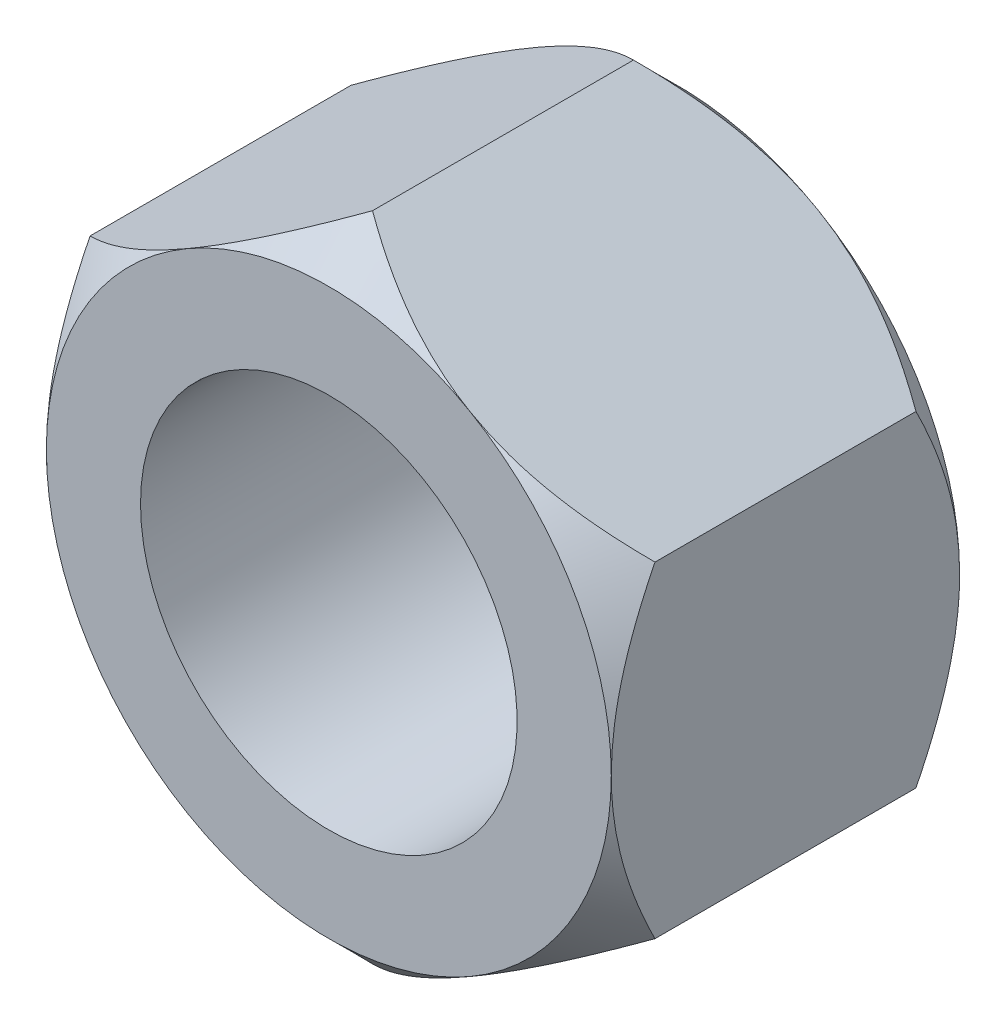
ISO-10303-21;
HEADER;
FILE_DESCRIPTION(('STEP AP214'),'2;1');
FILE_NAME('part.step','',(''),(''),'','','');
FILE_SCHEMA(('AUTOMOTIVE_DESIGN { 1 0 10303 214 1 1 1 1 }'));
ENDSEC;
DATA;
#1=APPLICATION_CONTEXT('core data for automotive mechanical design processes');
#2=APPLICATION_PROTOCOL_DEFINITION('international standard','automotive_design',2000,#1);
#3=PRODUCT_CONTEXT('',#1,'mechanical');
#4=PRODUCT('Part','Part','',(#3));
#5=PRODUCT_RELATED_PRODUCT_CATEGORY('part','',(#4));
#6=PRODUCT_DEFINITION_FORMATION('','',#4);
#7=PRODUCT_DEFINITION_CONTEXT('part definition',#1,'design');
#8=PRODUCT_DEFINITION('design','',#6,#7);
#9=PRODUCT_DEFINITION_SHAPE('','',#8);
#10=(LENGTH_UNIT() NAMED_UNIT(*) SI_UNIT(.MILLI.,.METRE.));
#11=(NAMED_UNIT(*) PLANE_ANGLE_UNIT() SI_UNIT($,.RADIAN.));
#12=(NAMED_UNIT(*) SI_UNIT($,.STERADIAN.) SOLID_ANGLE_UNIT());
#13=UNCERTAINTY_MEASURE_WITH_UNIT(LENGTH_MEASURE(1.E-05),#10,'distance_accuracy_value','');
#14=(GEOMETRIC_REPRESENTATION_CONTEXT(3) GLOBAL_UNCERTAINTY_ASSIGNED_CONTEXT((#13)) GLOBAL_UNIT_ASSIGNED_CONTEXT((#10,
#11,#12)) REPRESENTATION_CONTEXT('',''));
#15=CARTESIAN_POINT('',(0.,0.,0.));
#16=DIRECTION('',(0.,0.,1.));
#17=DIRECTION('',(1.,0.,0.));
#18=AXIS2_PLACEMENT_3D('',#15,#16,#17);
#19=CARTESIAN_POINT('',(0.,13.856406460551,14.8));
#20=DIRECTION('',(0.5,-0.866025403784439,0.));
#21=DIRECTION('',(0.866025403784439,0.5,0.));
#22=AXIS2_PLACEMENT_3D('',#19,#20,#21);
#23=PLANE('',#22);
#24=DIRECTION('',(0.,0.,-1.));
#25=VECTOR('',#24,1.);
#26=CARTESIAN_POINT('',(0.,13.856406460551,14.8));
#27=LINE('',#26,#25);
#28=CARTESIAN_POINT('',(0.,13.856406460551,12.943593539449));
#29=VERTEX_POINT('',#28);
#30=CARTESIAN_POINT('',(0.,13.856406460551,1.85640646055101));
#31=VERTEX_POINT('',#30);
#32=EDGE_CURVE('E199',#29,#31,#27,.T.);
#33=ORIENTED_EDGE('',*,*,#32,.T.);
#34=CARTESIAN_POINT('',(0.000199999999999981,13.8565219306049,1.85652193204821));
#35=CARTESIAN_POINT('',(-0.20610632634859,13.737410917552,1.73742850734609));
#36=CARTESIAN_POINT('',(-0.414028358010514,13.6173670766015,1.62196918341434));
#37=CARTESIAN_POINT('',(-0.833355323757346,13.3752685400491,1.39947310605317));
#38=CARTESIAN_POINT('',(-1.04476208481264,13.2532127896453,1.29244095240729));
#39=CARTESIAN_POINT('',(-1.47230711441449,13.006369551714,1.08750030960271));
#40=CARTESIAN_POINT('',(-1.68846554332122,12.8815704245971,0.98964756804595));
#41=CARTESIAN_POINT('',(-2.12433269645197,12.6299224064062,0.805191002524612));
#42=CARTESIAN_POINT('',(-2.34404087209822,12.5030738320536,0.718585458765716));
#43=CARTESIAN_POINT('',(-2.78347501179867,12.2493664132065,0.559363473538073));
#44=CARTESIAN_POINT('',(-3.00314697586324,12.1225387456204,0.486549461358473));
#45=CARTESIAN_POINT('',(-3.44557027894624,11.8671055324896,0.354726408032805));
#46=CARTESIAN_POINT('',(-3.66832128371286,11.7385001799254,0.295715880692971));
#47=CARTESIAN_POINT('',(-4.11594990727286,11.480061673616,0.192985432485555));
#48=CARTESIAN_POINT('',(-4.34082154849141,11.3502319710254,0.149231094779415));
#49=CARTESIAN_POINT('',(-4.79245266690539,11.0894826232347,0.0779744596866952));
#50=CARTESIAN_POINT('',(-5.01921185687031,10.9585631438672,0.050469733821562));
#51=CARTESIAN_POINT('',(-5.57180671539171,10.639522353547,0.00435195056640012));
#52=CARTESIAN_POINT('',(-5.8982396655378,10.4510562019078,-0.00532569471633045));
#53=CARTESIAN_POINT('',(-6.55051516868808,10.0744647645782,0.0109189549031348));
#54=CARTESIAN_POINT('',(-6.87635747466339,9.88633962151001,0.0368537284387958));
#55=CARTESIAN_POINT('',(-7.52497050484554,9.51186271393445,0.122792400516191));
#56=CARTESIAN_POINT('',(-7.84773738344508,9.32551316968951,0.182834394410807));
#57=CARTESIAN_POINT('',(-8.48772338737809,8.9560170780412,0.333723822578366));
#58=CARTESIAN_POINT('',(-8.80494293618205,8.77287028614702,0.424568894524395));
#59=CARTESIAN_POINT('',(-9.36804564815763,8.44776278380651,0.61145843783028));
#60=CARTESIAN_POINT('',(-9.61517605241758,8.30508197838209,0.702586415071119));
#61=CARTESIAN_POINT('',(-10.1050009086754,8.02228146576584,0.899526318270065));
#62=CARTESIAN_POINT('',(-10.3476952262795,7.88216183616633,1.00533868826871));
#63=CARTESIAN_POINT('',(-10.8278834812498,7.60492501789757,1.22927571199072));
#64=CARTESIAN_POINT('',(-11.0653910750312,7.4677999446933,1.3473616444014));
#65=CARTESIAN_POINT('',(-11.5360086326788,7.19608877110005,1.59429570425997));
#66=CARTESIAN_POINT('',(-11.769121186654,7.06150117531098,1.72313723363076));
#67=CARTESIAN_POINT('',(-12.0002,6.92808776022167,1.85652193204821));
#68=B_SPLINE_CURVE_WITH_KNOTS('',3,(#34,#35,#36,#37,#38,#39,#40,#41,#42,#43,#44,#45,#46,#47,#48,
#49,#50,#51,#52,#53,#54,#55,#56,#57,#58,#59,#60,#61,#62,#63,#64,#65,#66,#67),.UNSPECIFIED.,.F.,
.F.,(4,2,2,2,2,2,2,2,2,2,2,2,2,2,2,2,4),(0.,0.799031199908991,1.59849555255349,2.40253734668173,
3.20645605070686,3.99780391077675,4.78906652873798,5.57853238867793,6.36788023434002,
7.49728680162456,8.62708921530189,9.75815602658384,10.8891361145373,11.7873913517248,
12.6856737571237,13.58120361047,14.4761880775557),.UNSPECIFIED.);
#69=CARTESIAN_POINT('',(-6.,10.3923048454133,0.));
#70=VERTEX_POINT('',#69);
#71=EDGE_CURVE('E48',#31,#70,#68,.T.);
#72=ORIENTED_EDGE('',*,*,#71,.T.);
#73=CARTESIAN_POINT('',(-12.,6.92820323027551,1.85640646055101));
#74=VERTEX_POINT('',#73);
#75=EDGE_CURVE('E143',#70,#74,#68,.T.);
#76=ORIENTED_EDGE('',*,*,#75,.T.);
#77=DIRECTION('',(0.,0.,-1.));
#78=VECTOR('',#77,1.);
#79=CARTESIAN_POINT('',(-12.,6.92820323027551,14.8));
#80=LINE('',#79,#78);
#81=CARTESIAN_POINT('',(-12.,6.92820323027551,12.943593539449));
#82=VERTEX_POINT('',#81);
#83=EDGE_CURVE('E154',#82,#74,#80,.T.);
#84=ORIENTED_EDGE('',*,*,#83,.F.);
#85=CARTESIAN_POINT('',(0.0002,13.8565219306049,12.9434780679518));
#86=CARTESIAN_POINT('',(-0.206106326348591,13.737410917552,13.0625714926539));
#87=CARTESIAN_POINT('',(-0.414028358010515,13.6173670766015,13.1780308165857));
#88=CARTESIAN_POINT('',(-0.833355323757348,13.3752685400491,13.4005268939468));
#89=CARTESIAN_POINT('',(-1.04476208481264,13.2532127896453,13.5075590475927));
#90=CARTESIAN_POINT('',(-1.47230711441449,13.006369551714,13.7124996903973));
#91=CARTESIAN_POINT('',(-1.68846554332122,12.8815704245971,13.8103524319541));
#92=CARTESIAN_POINT('',(-2.12433269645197,12.6299224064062,13.9948089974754));
#93=CARTESIAN_POINT('',(-2.34404087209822,12.5030738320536,14.0814145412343));
#94=CARTESIAN_POINT('',(-2.78347501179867,12.2493664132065,14.2406365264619));
#95=CARTESIAN_POINT('',(-3.00314697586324,12.1225387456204,14.3134505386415));
#96=CARTESIAN_POINT('',(-3.44557027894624,11.8671055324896,14.4452735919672));
#97=CARTESIAN_POINT('',(-3.66832128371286,11.7385001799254,14.504284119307));
#98=CARTESIAN_POINT('',(-4.11594990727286,11.480061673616,14.6070145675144));
#99=CARTESIAN_POINT('',(-4.34082154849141,11.3502319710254,14.6507689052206));
#100=CARTESIAN_POINT('',(-4.79245266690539,11.0894826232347,14.7220255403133));
#101=CARTESIAN_POINT('',(-5.01921185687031,10.9585631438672,14.7495302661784));
#102=CARTESIAN_POINT('',(-5.57180671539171,10.639522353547,14.7956480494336));
#103=CARTESIAN_POINT('',(-5.8982396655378,10.4510562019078,14.8053256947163));
#104=CARTESIAN_POINT('',(-6.55051516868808,10.0744647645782,14.7890810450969));
#105=CARTESIAN_POINT('',(-6.87635747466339,9.88633962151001,14.7631462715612));
#106=CARTESIAN_POINT('',(-7.52497050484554,9.51186271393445,14.6772075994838));
#107=CARTESIAN_POINT('',(-7.84773738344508,9.32551316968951,14.6171656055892));
#108=CARTESIAN_POINT('',(-8.48772338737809,8.9560170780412,14.4662761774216));
#109=CARTESIAN_POINT('',(-8.80494293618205,8.77287028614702,14.3754311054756));
#110=CARTESIAN_POINT('',(-9.36804564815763,8.44776278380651,14.1885415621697));
#111=CARTESIAN_POINT('',(-9.61517605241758,8.30508197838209,14.0974135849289));
#112=CARTESIAN_POINT('',(-10.1050009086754,8.02228146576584,13.9004736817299));
#113=CARTESIAN_POINT('',(-10.3476952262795,7.88216183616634,13.7946613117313));
#114=CARTESIAN_POINT('',(-10.8278834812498,7.60492501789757,13.5707242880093));
#115=CARTESIAN_POINT('',(-11.0653910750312,7.4677999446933,13.4526383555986));
#116=CARTESIAN_POINT('',(-11.5360086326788,7.19608877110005,13.20570429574));
#117=CARTESIAN_POINT('',(-11.769121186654,7.06150117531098,13.0768627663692));
#118=CARTESIAN_POINT('',(-12.0002,6.92808776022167,12.9434780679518));
#119=B_SPLINE_CURVE_WITH_KNOTS('',3,(#85,#86,#87,#88,#89,#90,#91,#92,#93,#94,#95,#96,#97,#98,
#99,#100,#101,#102,#103,#104,#105,#106,#107,#108,#109,#110,#111,#112,#113,#114,#115,#116,#117,
#118),.UNSPECIFIED.,.F.,.F.,(4,2,2,2,2,2,2,2,2,2,2,2,2,2,2,2,4),(0.,0.799031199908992,
1.59849555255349,2.40253734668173,3.20645605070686,3.99780391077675,4.78906652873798,
5.57853238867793,6.36788023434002,7.49728680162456,8.62708921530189,9.75815602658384,
10.8891361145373,11.7873913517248,12.6856737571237,13.58120361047,14.4761880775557),.UNSPECIFIED.);
#120=CARTESIAN_POINT('',(-6.,10.3923048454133,14.8));
#121=VERTEX_POINT('',#120);
#122=EDGE_CURVE('E240',#121,#82,#119,.T.);
#123=ORIENTED_EDGE('',*,*,#122,.F.);
#124=EDGE_CURVE('E229',#29,#121,#119,.T.);
#125=ORIENTED_EDGE('',*,*,#124,.F.);
#126=EDGE_LOOP('',(#33,#72,#76,#84,#123,#125));
#127=FACE_BOUND('',#126,.T.);
#128=ADVANCED_FACE('F32',(#127),#23,.F.);
#129=CARTESIAN_POINT('',(-12.,6.92820323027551,14.8));
#130=DIRECTION('',(1.,0.,0.));
#131=DIRECTION('',(0.,0.,-1.));
#132=AXIS2_PLACEMENT_3D('',#129,#130,#131);
#133=PLANE('',#132);
#134=ORIENTED_EDGE('',*,*,#83,.T.);
#135=CARTESIAN_POINT('',(-12.,-17.3197983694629,9.07072413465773));
#136=CARTESIAN_POINT('',(-12.,-17.1018243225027,8.89155627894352));
#137=CARTESIAN_POINT('',(-12.,-16.8833157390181,8.71303891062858));
#138=CARTESIAN_POINT('',(-12.,-16.4451228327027,8.35744705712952));
#139=CARTESIAN_POINT('',(-12.,-16.225438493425,8.18037259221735));
#140=CARTESIAN_POINT('',(-12.,-15.5643649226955,7.65144903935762));
#141=CARTESIAN_POINT('',(-12.,-15.1210600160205,7.30198622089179));
#142=CARTESIAN_POINT('',(-12.,-14.2234399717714,6.60711121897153));
#143=CARTESIAN_POINT('',(-12.,-13.7690573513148,6.26178597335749));
#144=CARTESIAN_POINT('',(-12.,-12.8528218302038,5.58126706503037));
#145=CARTESIAN_POINT('',(-12.,-12.3909696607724,5.24607241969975));
#146=CARTESIAN_POINT('',(-12.,-11.4139919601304,4.55740600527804));
#147=CARTESIAN_POINT('',(-12.,-10.8979613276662,4.20520674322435));
#148=CARTESIAN_POINT('',(-12.,-10.1137064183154,3.69229585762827));
#149=CARTESIAN_POINT('',(-12.,-9.85053041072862,3.5238565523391));
#150=CARTESIAN_POINT('',(-12.,-9.32042416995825,3.19300363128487));
#151=CARTESIAN_POINT('',(-12.,-9.05349412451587,3.03058971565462));
#152=CARTESIAN_POINT('',(-12.,-8.51671146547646,2.71352101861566));
#153=CARTESIAN_POINT('',(-12.,-8.24687797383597,2.55883394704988));
#154=CARTESIAN_POINT('',(-12.,-7.70266171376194,2.25761649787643));
#155=CARTESIAN_POINT('',(-12.,-7.42827870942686,2.11108654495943));
#156=CARTESIAN_POINT('',(-12.,-6.8747809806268,1.82773083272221));
#157=CARTESIAN_POINT('',(-12.,-6.59566984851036,1.6908980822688));
#158=CARTESIAN_POINT('',(-12.,-6.03221467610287,1.42853162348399));
#159=CARTESIAN_POINT('',(-12.,-5.74787158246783,1.30299589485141));
#160=CARTESIAN_POINT('',(-12.,-5.25714492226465,1.09974243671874));
#161=CARTESIAN_POINT('',(-12.,-5.05212707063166,1.01873251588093));
#162=CARTESIAN_POINT('',(-12.,-4.63932060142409,0.864160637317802));
#163=CARTESIAN_POINT('',(-12.,-4.43153200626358,0.79059861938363));
#164=CARTESIAN_POINT('',(-12.,-3.8038926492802,0.5822904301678));
#165=CARTESIAN_POINT('',(-12.,-3.37975926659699,0.45991830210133));
#166=CARTESIAN_POINT('',(-12.,-2.74129224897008,0.307442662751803));
#167=CARTESIAN_POINT('',(-12.,-2.53050472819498,0.262144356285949));
#168=CARTESIAN_POINT('',(-12.,-2.10699413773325,0.181799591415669));
#169=CARTESIAN_POINT('',(-12.,-1.89427138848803,0.146751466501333));
#170=CARTESIAN_POINT('',(-12.,-1.46733523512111,0.0875300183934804));
#171=CARTESIAN_POINT('',(-12.,-1.25312197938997,0.0633556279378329));
#172=CARTESIAN_POINT('',(-12.,-0.82371476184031,0.0263361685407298));
#173=CARTESIAN_POINT('',(-12.,-0.608520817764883,0.0134908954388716));
#174=CARTESIAN_POINT('',(-12.,-0.189172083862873,-0.000240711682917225));
#175=CARTESIAN_POINT('',(-12.,0.0149632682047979,-0.00172481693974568));
#176=CARTESIAN_POINT('',(-12.,0.423066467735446,0.00572177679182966));
#177=CARTESIAN_POINT('',(-12.,0.627034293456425,0.0146536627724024));
#178=CARTESIAN_POINT('',(-12.,1.03424406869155,0.0427744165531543));
#179=CARTESIAN_POINT('',(-12.,1.23748607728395,0.0619624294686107));
#180=CARTESIAN_POINT('',(-12.,1.64279854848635,0.110253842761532));
#181=CARTESIAN_POINT('',(-12.,1.8448688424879,0.139358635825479));
#182=CARTESIAN_POINT('',(-12.,2.45637150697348,0.242161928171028));
#183=CARTESIAN_POINT('',(-12.,2.86336198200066,0.330792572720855));
#184=CARTESIAN_POINT('',(-12.,3.66816252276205,0.542100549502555));
#185=CARTESIAN_POINT('',(-12.,4.06597273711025,0.664777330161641));
#186=CARTESIAN_POINT('',(-12.,4.86071136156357,0.941581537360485));
#187=CARTESIAN_POINT('',(-12.,5.25740700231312,1.09637017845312));
#188=CARTESIAN_POINT('',(-12.,6.0406537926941,1.42995971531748));
#189=CARTESIAN_POINT('',(-12.,6.42720041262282,1.60877112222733));
#190=CARTESIAN_POINT('',(-12.,7.19193181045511,1.98616974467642));
#191=CARTESIAN_POINT('',(-12.,7.5700868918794,2.18481665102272));
#192=CARTESIAN_POINT('',(-12.,8.31775652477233,2.59753155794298));
#193=CARTESIAN_POINT('',(-12.,8.68727235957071,2.81159724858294));
#194=CARTESIAN_POINT('',(-12.,9.40069797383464,3.24126382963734));
#195=CARTESIAN_POINT('',(-12.,9.74497050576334,3.45626557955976));
#196=CARTESIAN_POINT('',(-12.,10.4275998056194,3.89549023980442));
#197=CARTESIAN_POINT('',(-12.,10.7659561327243,4.1197138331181));
#198=CARTESIAN_POINT('',(-12.,11.4348299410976,4.57393845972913));
#199=CARTESIAN_POINT('',(-12.,11.7653883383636,4.80387945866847));
#200=CARTESIAN_POINT('',(-12.,12.4219603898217,5.26997911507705));
#201=CARTESIAN_POINT('',(-12.,12.7479752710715,5.5061360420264));
#202=CARTESIAN_POINT('',(-12.,13.0720818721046,5.74483937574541));
#203=B_SPLINE_CURVE_WITH_KNOTS('',3,(#135,#136,#137,#138,#139,#140,#141,#142,#143,#144,#145,
#146,#147,#148,#149,#150,#151,#152,#153,#154,#155,#156,#157,#158,#159,#160,#161,#162,#163,#164,
#165,#166,#167,#168,#169,#170,#171,#172,#173,#174,#175,#176,#177,#178,#179,#180,#181,#182,#183,
#184,#185,#186,#187,#188,#189,#190,#191,#192,#193,#194,#195,#196,#197,#198,#199,#200,#201,#202),
.UNSPECIFIED.,.F.,.F.,(4,2,2,2,2,2,2,2,2,2,2,2,2,2,2,2,2,2,2,2,2,2,2,2,2,2,2,2,2,2,2,2,2,4),(0.,
0.846475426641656,1.69296272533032,3.38634499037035,5.09836828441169,6.81022498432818,
8.6840920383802,9.62141842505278,10.5586981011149,11.4916610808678,12.4246725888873,
13.3570044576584,14.2891692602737,14.9503568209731,15.6115390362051,16.9338740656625,
17.5804743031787,18.2269693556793,18.8734009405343,19.5198208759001,20.1319787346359,
20.7442063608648,21.3563829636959,21.9686455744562,23.2163337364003,24.464001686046,
25.7404988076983,27.0175562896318,28.2985797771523,29.5794117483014,30.7969195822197,
32.0145177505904,33.2224448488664,34.430039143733),.UNSPECIFIED.);
#204=CARTESIAN_POINT('',(-12.,0.,0.));
#205=VERTEX_POINT('',#204);
#206=EDGE_CURVE('E137',#74,#205,#203,.F.);
#207=ORIENTED_EDGE('',*,*,#206,.T.);
#208=CARTESIAN_POINT('',(-12.,-6.92820323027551,1.85640646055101));
#209=VERTEX_POINT('',#208);
#210=EDGE_CURVE('E125',#205,#209,#203,.F.);
#211=ORIENTED_EDGE('',*,*,#210,.T.);
#212=DIRECTION('',(0.,0.,-1.));
#213=VECTOR('',#212,1.);
#214=CARTESIAN_POINT('',(-12.,-6.92820323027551,14.8));
#215=LINE('',#214,#213);
#216=CARTESIAN_POINT('',(-12.,-6.92820323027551,12.943593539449));
#217=VERTEX_POINT('',#216);
#218=EDGE_CURVE('E321',#217,#209,#215,.T.);
#219=ORIENTED_EDGE('',*,*,#218,.F.);
#220=CARTESIAN_POINT('',(-12.,-17.3197983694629,5.72927586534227));
#221=CARTESIAN_POINT('',(-12.,-17.1018243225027,5.90844372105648));
#222=CARTESIAN_POINT('',(-12.,-16.8833157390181,6.08696108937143));
#223=CARTESIAN_POINT('',(-12.,-16.4451228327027,6.44255294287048));
#224=CARTESIAN_POINT('',(-12.,-16.225438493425,6.61962740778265));
#225=CARTESIAN_POINT('',(-12.,-15.5643649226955,7.14855096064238));
#226=CARTESIAN_POINT('',(-12.,-15.1210600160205,7.49801377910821));
#227=CARTESIAN_POINT('',(-12.,-14.2234399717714,8.19288878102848));
#228=CARTESIAN_POINT('',(-12.,-13.7690573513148,8.53821402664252));
#229=CARTESIAN_POINT('',(-12.,-12.8528218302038,9.21873293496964));
#230=CARTESIAN_POINT('',(-12.,-12.3909696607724,9.55392758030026));
#231=CARTESIAN_POINT('',(-12.,-11.4139919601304,10.242593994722));
#232=CARTESIAN_POINT('',(-12.,-10.8979613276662,10.5947932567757));
#233=CARTESIAN_POINT('',(-12.,-10.1137064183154,11.1077041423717));
#234=CARTESIAN_POINT('',(-12.,-9.85053041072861,11.2761434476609));
#235=CARTESIAN_POINT('',(-12.,-9.32042416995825,11.6069963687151));
#236=CARTESIAN_POINT('',(-12.,-9.05349412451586,11.7694102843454));
#237=CARTESIAN_POINT('',(-12.,-8.51671146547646,12.0864789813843));
#238=CARTESIAN_POINT('',(-12.,-8.24687797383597,12.2411660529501));
#239=CARTESIAN_POINT('',(-12.,-7.70266171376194,12.5423835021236));
#240=CARTESIAN_POINT('',(-12.,-7.42827870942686,12.6889134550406));
#241=CARTESIAN_POINT('',(-12.,-6.87478098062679,12.9722691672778));
#242=CARTESIAN_POINT('',(-12.,-6.59566984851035,13.1091019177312));
#243=CARTESIAN_POINT('',(-12.,-6.03221467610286,13.371468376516));
#244=CARTESIAN_POINT('',(-12.,-5.74787158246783,13.4970041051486));
#245=CARTESIAN_POINT('',(-12.,-5.25714492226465,13.7002575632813));
#246=CARTESIAN_POINT('',(-12.,-5.05212707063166,13.7812674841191));
#247=CARTESIAN_POINT('',(-12.,-4.63932060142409,13.9358393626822));
#248=CARTESIAN_POINT('',(-12.,-4.43153200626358,14.0094013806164));
#249=CARTESIAN_POINT('',(-12.,-3.8038926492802,14.2177095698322));
#250=CARTESIAN_POINT('',(-12.,-3.37975926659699,14.3400816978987));
#251=CARTESIAN_POINT('',(-12.,-2.74129224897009,14.4925573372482));
#252=CARTESIAN_POINT('',(-12.,-2.53050472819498,14.5378556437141));
#253=CARTESIAN_POINT('',(-12.,-2.10699413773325,14.6182004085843));
#254=CARTESIAN_POINT('',(-12.,-1.89427138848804,14.6532485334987));
#255=CARTESIAN_POINT('',(-12.,-1.46733523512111,14.7124699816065));
#256=CARTESIAN_POINT('',(-12.,-1.25312197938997,14.7366443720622));
#257=CARTESIAN_POINT('',(-12.,-0.823714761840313,14.7736638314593));
#258=CARTESIAN_POINT('',(-12.,-0.608520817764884,14.7865091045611));
#259=CARTESIAN_POINT('',(-12.,-0.189172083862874,14.8002407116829));
#260=CARTESIAN_POINT('',(-12.,0.0149632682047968,14.8017248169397));
#261=CARTESIAN_POINT('',(-12.,0.423066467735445,14.7942782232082));
#262=CARTESIAN_POINT('',(-12.,0.627034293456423,14.7853463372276));
#263=CARTESIAN_POINT('',(-12.,1.03424406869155,14.7572255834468));
#264=CARTESIAN_POINT('',(-12.,1.23748607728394,14.7380375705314));
#265=CARTESIAN_POINT('',(-12.,1.64279854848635,14.6897461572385));
#266=CARTESIAN_POINT('',(-12.,1.8448688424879,14.6606413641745));
#267=CARTESIAN_POINT('',(-12.,2.45637150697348,14.557838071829));
#268=CARTESIAN_POINT('',(-12.,2.86336198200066,14.4692074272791));
#269=CARTESIAN_POINT('',(-12.,3.66816252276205,14.2578994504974));
#270=CARTESIAN_POINT('',(-12.,4.06597273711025,14.1352226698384));
#271=CARTESIAN_POINT('',(-12.,4.86071136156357,13.8584184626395));
#272=CARTESIAN_POINT('',(-12.,5.25740700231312,13.7036298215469));
#273=CARTESIAN_POINT('',(-12.,6.0406537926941,13.3700402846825));
#274=CARTESIAN_POINT('',(-12.,6.42720041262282,13.1912288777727));
#275=CARTESIAN_POINT('',(-12.,7.19193181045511,12.8138302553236));
#276=CARTESIAN_POINT('',(-12.,7.5700868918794,12.6151833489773));
#277=CARTESIAN_POINT('',(-12.,8.31775652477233,12.202468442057));
#278=CARTESIAN_POINT('',(-12.,8.6872723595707,11.9884027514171));
#279=CARTESIAN_POINT('',(-12.,9.40069797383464,11.5587361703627));
#280=CARTESIAN_POINT('',(-12.,9.74497050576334,11.3437344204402));
#281=CARTESIAN_POINT('',(-12.,10.4275998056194,10.9045097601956));
#282=CARTESIAN_POINT('',(-12.,10.7659561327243,10.6802861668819));
#283=CARTESIAN_POINT('',(-12.,11.4348299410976,10.2260615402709));
#284=CARTESIAN_POINT('',(-12.,11.7653883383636,9.99612054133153));
#285=CARTESIAN_POINT('',(-12.,12.4219603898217,9.53002088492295));
#286=CARTESIAN_POINT('',(-12.,12.7479752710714,9.2938639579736));
#287=CARTESIAN_POINT('',(-12.,13.0720818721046,9.05516062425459));
#288=B_SPLINE_CURVE_WITH_KNOTS('',3,(#220,#221,#222,#223,#224,#225,#226,#227,#228,#229,#230,
#231,#232,#233,#234,#235,#236,#237,#238,#239,#240,#241,#242,#243,#244,#245,#246,#247,#248,#249,
#250,#251,#252,#253,#254,#255,#256,#257,#258,#259,#260,#261,#262,#263,#264,#265,#266,#267,#268,
#269,#270,#271,#272,#273,#274,#275,#276,#277,#278,#279,#280,#281,#282,#283,#284,#285,#286,#287),
.UNSPECIFIED.,.F.,.F.,(4,2,2,2,2,2,2,2,2,2,2,2,2,2,2,2,2,2,2,2,2,2,2,2,2,2,2,2,2,2,2,2,2,4),(0.,
0.846475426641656,1.69296272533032,3.38634499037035,5.09836828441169,6.81022498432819,
8.6840920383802,9.62141842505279,10.5586981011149,11.4916610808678,12.4246725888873,
13.3570044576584,14.2891692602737,14.9503568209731,15.6115390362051,16.9338740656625,
17.5804743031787,18.2269693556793,18.8734009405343,19.5198208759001,20.1319787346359,
20.7442063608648,21.3563829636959,21.9686455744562,23.2163337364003,24.464001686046,
25.7404988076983,27.0175562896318,28.2985797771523,29.5794117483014,30.7969195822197,
32.0145177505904,33.2224448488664,34.430039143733),.UNSPECIFIED.);
#289=CARTESIAN_POINT('',(-12.,0.,14.8));
#290=VERTEX_POINT('',#289);
#291=EDGE_CURVE('E184',#290,#217,#288,.F.);
#292=ORIENTED_EDGE('',*,*,#291,.F.);
#293=EDGE_CURVE('E191',#82,#290,#288,.F.);
#294=ORIENTED_EDGE('',*,*,#293,.F.);
#295=EDGE_LOOP('',(#134,#207,#211,#219,#292,#294));
#296=FACE_BOUND('',#295,.T.);
#297=ADVANCED_FACE('F151',(#296),#133,.F.);
#298=CARTESIAN_POINT('',(-12.,-6.92820323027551,14.8));
#299=DIRECTION('',(0.5,0.866025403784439,0.));
#300=DIRECTION('',(-0.866025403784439,0.5,0.));
#301=AXIS2_PLACEMENT_3D('',#298,#299,#300);
#302=PLANE('',#301);
#303=ORIENTED_EDGE('',*,*,#218,.T.);
#304=CARTESIAN_POINT('',(-12.0002,-6.92808776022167,1.85652193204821));
#305=CARTESIAN_POINT('',(-11.7938936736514,-7.04719877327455,1.73742850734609));
#306=CARTESIAN_POINT('',(-11.5859716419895,-7.16724261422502,1.62196918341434));
#307=CARTESIAN_POINT('',(-11.1666446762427,-7.40934115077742,1.39947310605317));
#308=CARTESIAN_POINT('',(-10.9552379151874,-7.5313969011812,1.29244095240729));
#309=CARTESIAN_POINT('',(-10.5276928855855,-7.77824013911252,1.08750030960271));
#310=CARTESIAN_POINT('',(-10.3115344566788,-7.90303926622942,0.989647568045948));
#311=CARTESIAN_POINT('',(-9.87566730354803,-8.15468728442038,0.80519100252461));
#312=CARTESIAN_POINT('',(-9.65595912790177,-8.28153585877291,0.718585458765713));
#313=CARTESIAN_POINT('',(-9.21652498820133,-8.53524327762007,0.55936347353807));
#314=CARTESIAN_POINT('',(-8.99685302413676,-8.66207094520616,0.48654946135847));
#315=CARTESIAN_POINT('',(-8.55442972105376,-8.91750415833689,0.354726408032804));
#316=CARTESIAN_POINT('',(-8.33167871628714,-9.04610951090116,0.295715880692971));
#317=CARTESIAN_POINT('',(-7.88405009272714,-9.30454801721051,0.192985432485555));
#318=CARTESIAN_POINT('',(-7.65917845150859,-9.43437771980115,0.149231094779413));
#319=CARTESIAN_POINT('',(-7.20754733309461,-9.69512706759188,0.0779744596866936));
#320=CARTESIAN_POINT('',(-6.98078814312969,-9.82604654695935,0.0504697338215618));
#321=CARTESIAN_POINT('',(-6.42819328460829,-10.1450873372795,0.0043519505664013));
#322=CARTESIAN_POINT('',(-6.1017603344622,-10.3335534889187,-0.00532569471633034));
#323=CARTESIAN_POINT('',(-5.44948483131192,-10.7101449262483,0.0109189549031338));
#324=CARTESIAN_POINT('',(-5.12364252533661,-10.8982700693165,0.036853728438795));
#325=CARTESIAN_POINT('',(-4.47502949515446,-11.2727469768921,0.122792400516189));
#326=CARTESIAN_POINT('',(-4.15226261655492,-11.459096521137,0.182834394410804));
#327=CARTESIAN_POINT('',(-3.51227661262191,-11.8285926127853,0.333723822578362));
#328=CARTESIAN_POINT('',(-3.19505706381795,-12.0117394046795,0.424568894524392));
#329=CARTESIAN_POINT('',(-2.63195435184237,-12.33684690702,0.611458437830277));
#330=CARTESIAN_POINT('',(-2.38482394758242,-12.4795277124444,0.702586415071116));
#331=CARTESIAN_POINT('',(-1.89499909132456,-12.7623282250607,0.899526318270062));
#332=CARTESIAN_POINT('',(-1.65230477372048,-12.9024478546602,1.00533868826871));
#333=CARTESIAN_POINT('',(-1.17211651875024,-13.179684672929,1.22927571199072));
#334=CARTESIAN_POINT('',(-0.934608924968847,-13.3168097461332,1.3473616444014));
#335=CARTESIAN_POINT('',(-0.463991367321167,-13.5885209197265,1.59429570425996));
#336=CARTESIAN_POINT('',(-0.230878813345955,-13.7231085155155,1.72313723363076));
#337=CARTESIAN_POINT('',(0.000199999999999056,-13.8565219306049,1.85652193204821));
#338=B_SPLINE_CURVE_WITH_KNOTS('',3,(#304,#305,#306,#307,#308,#309,#310,#311,#312,#313,#314,
#315,#316,#317,#318,#319,#320,#321,#322,#323,#324,#325,#326,#327,#328,#329,#330,#331,#332,#333,
#334,#335,#336,#337),.UNSPECIFIED.,.F.,.F.,(4,2,2,2,2,2,2,2,2,2,2,2,2,2,2,2,4),(0.,
0.799031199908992,1.5984955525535,2.40253734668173,3.20645605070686,3.99780391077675,
4.78906652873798,5.57853238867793,6.36788023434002,7.49728680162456,8.62708921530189,
9.75815602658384,10.8891361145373,11.7873913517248,12.6856737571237,13.58120361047,
14.4761880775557),.UNSPECIFIED.);
#339=CARTESIAN_POINT('',(-6.,-10.3923048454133,0.));
#340=VERTEX_POINT('',#339);
#341=EDGE_CURVE('E132',#209,#340,#338,.T.);
#342=ORIENTED_EDGE('',*,*,#341,.T.);
#343=CARTESIAN_POINT('',(0.,-13.856406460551,1.85640646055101));
#344=VERTEX_POINT('',#343);
#345=EDGE_CURVE('E165',#340,#344,#338,.T.);
#346=ORIENTED_EDGE('',*,*,#345,.T.);
#347=DIRECTION('',(0.,0.,-1.));
#348=VECTOR('',#347,1.);
#349=CARTESIAN_POINT('',(0.,-13.856406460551,14.8));
#350=LINE('',#349,#348);
#351=CARTESIAN_POINT('',(0.,-13.856406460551,12.943593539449));
#352=VERTEX_POINT('',#351);
#353=EDGE_CURVE('E322',#352,#344,#350,.T.);
#354=ORIENTED_EDGE('',*,*,#353,.F.);
#355=CARTESIAN_POINT('',(-12.0002,-6.92808776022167,12.9434780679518));
#356=CARTESIAN_POINT('',(-11.7938936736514,-7.04719877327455,13.0625714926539));
#357=CARTESIAN_POINT('',(-11.5859716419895,-7.16724261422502,13.1780308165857));
#358=CARTESIAN_POINT('',(-11.1666446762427,-7.40934115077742,13.4005268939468));
#359=CARTESIAN_POINT('',(-10.9552379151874,-7.5313969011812,13.5075590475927));
#360=CARTESIAN_POINT('',(-10.5276928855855,-7.77824013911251,13.7124996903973));
#361=CARTESIAN_POINT('',(-10.3115344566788,-7.90303926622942,13.8103524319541));
#362=CARTESIAN_POINT('',(-9.87566730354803,-8.15468728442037,13.9948089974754));
#363=CARTESIAN_POINT('',(-9.65595912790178,-8.2815358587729,14.0814145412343));
#364=CARTESIAN_POINT('',(-9.21652498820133,-8.53524327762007,14.2406365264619));
#365=CARTESIAN_POINT('',(-8.99685302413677,-8.66207094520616,14.3134505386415));
#366=CARTESIAN_POINT('',(-8.55442972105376,-8.91750415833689,14.4452735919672));
#367=CARTESIAN_POINT('',(-8.33167871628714,-9.04610951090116,14.504284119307));
#368=CARTESIAN_POINT('',(-7.88405009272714,-9.30454801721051,14.6070145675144));
#369=CARTESIAN_POINT('',(-7.65917845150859,-9.43437771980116,14.6507689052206));
#370=CARTESIAN_POINT('',(-7.20754733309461,-9.69512706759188,14.7220255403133));
#371=CARTESIAN_POINT('',(-6.98078814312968,-9.82604654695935,14.7495302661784));
#372=CARTESIAN_POINT('',(-6.42819328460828,-10.1450873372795,14.7956480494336));
#373=CARTESIAN_POINT('',(-6.10176033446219,-10.3335534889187,14.8053256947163));
#374=CARTESIAN_POINT('',(-5.44948483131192,-10.7101449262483,14.7890810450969));
#375=CARTESIAN_POINT('',(-5.1236425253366,-10.8982700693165,14.7631462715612));
#376=CARTESIAN_POINT('',(-4.47502949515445,-11.2727469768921,14.6772075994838));
#377=CARTESIAN_POINT('',(-4.15226261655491,-11.459096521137,14.6171656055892));
#378=CARTESIAN_POINT('',(-3.5122766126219,-11.8285926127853,14.4662761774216));
#379=CARTESIAN_POINT('',(-3.19505706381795,-12.0117394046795,14.3754311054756));
#380=CARTESIAN_POINT('',(-2.63195435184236,-12.33684690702,14.1885415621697));
#381=CARTESIAN_POINT('',(-2.38482394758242,-12.4795277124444,14.0974135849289));
#382=CARTESIAN_POINT('',(-1.89499909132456,-12.7623282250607,13.9004736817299));
#383=CARTESIAN_POINT('',(-1.65230477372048,-12.9024478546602,13.7946613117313));
#384=CARTESIAN_POINT('',(-1.17211651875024,-13.179684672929,13.5707242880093));
#385=CARTESIAN_POINT('',(-0.934608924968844,-13.3168097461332,13.4526383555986));
#386=CARTESIAN_POINT('',(-0.463991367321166,-13.5885209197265,13.20570429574));
#387=CARTESIAN_POINT('',(-0.230878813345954,-13.7231085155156,13.0768627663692));
#388=CARTESIAN_POINT('',(0.000199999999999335,-13.8565219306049,12.9434780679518));
#389=B_SPLINE_CURVE_WITH_KNOTS('',3,(#355,#356,#357,#358,#359,#360,#361,#362,#363,#364,#365,
#366,#367,#368,#369,#370,#371,#372,#373,#374,#375,#376,#377,#378,#379,#380,#381,#382,#383,#384,
#385,#386,#387,#388),.UNSPECIFIED.,.F.,.F.,(4,2,2,2,2,2,2,2,2,2,2,2,2,2,2,2,4),(0.,
0.79903119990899,1.59849555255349,2.40253734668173,3.20645605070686,3.99780391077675,
4.78906652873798,5.57853238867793,6.36788023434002,7.49728680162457,8.6270892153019,
9.75815602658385,10.8891361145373,11.7873913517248,12.6856737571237,13.58120361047,
14.4761880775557),.UNSPECIFIED.);
#390=CARTESIAN_POINT('',(-6.,-10.3923048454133,14.8));
#391=VERTEX_POINT('',#390);
#392=EDGE_CURVE('E193',#391,#352,#389,.T.);
#393=ORIENTED_EDGE('',*,*,#392,.F.);
#394=EDGE_CURVE('E192',#217,#391,#389,.T.);
#395=ORIENTED_EDGE('',*,*,#394,.F.);
#396=EDGE_LOOP('',(#303,#342,#346,#354,#393,#395));
#397=FACE_BOUND('',#396,.T.);
#398=ADVANCED_FACE('F179',(#397),#302,.F.);
#399=CARTESIAN_POINT('',(12.,-6.92820323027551,14.8));
#400=DIRECTION('',(0.5,-0.866025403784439,0.));
#401=DIRECTION('',(0.866025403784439,0.5,0.));
#402=AXIS2_PLACEMENT_3D('',#399,#400,#401);
#403=PLANE('',#402);
#404=CARTESIAN_POINT('',(12.0002,-6.92808776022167,1.85652193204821));
#405=CARTESIAN_POINT('',(11.7938936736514,-7.04719877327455,1.73742850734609));
#406=CARTESIAN_POINT('',(11.5859716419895,-7.16724261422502,1.62196918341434));
#407=CARTESIAN_POINT('',(11.1666446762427,-7.40934115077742,1.39947310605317));
#408=CARTESIAN_POINT('',(10.9552379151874,-7.5313969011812,1.29244095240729));
#409=CARTESIAN_POINT('',(10.5276928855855,-7.77824013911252,1.08750030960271));
#410=CARTESIAN_POINT('',(10.3115344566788,-7.90303926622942,0.989647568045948));
#411=CARTESIAN_POINT('',(9.87566730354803,-8.15468728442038,0.80519100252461));
#412=CARTESIAN_POINT('',(9.65595912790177,-8.28153585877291,0.718585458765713));
#413=CARTESIAN_POINT('',(9.21652498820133,-8.53524327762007,0.55936347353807));
#414=CARTESIAN_POINT('',(8.99685302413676,-8.66207094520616,0.48654946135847));
#415=CARTESIAN_POINT('',(8.55442972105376,-8.91750415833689,0.354726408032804));
#416=CARTESIAN_POINT('',(8.33167871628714,-9.04610951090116,0.295715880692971));
#417=CARTESIAN_POINT('',(7.88405009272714,-9.30454801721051,0.192985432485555));
#418=CARTESIAN_POINT('',(7.65917845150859,-9.43437771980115,0.149231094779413));
#419=CARTESIAN_POINT('',(7.20754733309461,-9.69512706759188,0.0779744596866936));
#420=CARTESIAN_POINT('',(6.98078814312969,-9.82604654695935,0.0504697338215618));
#421=CARTESIAN_POINT('',(6.42819328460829,-10.1450873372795,0.0043519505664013));
#422=CARTESIAN_POINT('',(6.1017603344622,-10.3335534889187,-0.00532569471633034));
#423=CARTESIAN_POINT('',(5.44948483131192,-10.7101449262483,0.0109189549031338));
#424=CARTESIAN_POINT('',(5.12364252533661,-10.8982700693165,0.036853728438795));
#425=CARTESIAN_POINT('',(4.47502949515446,-11.2727469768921,0.122792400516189));
#426=CARTESIAN_POINT('',(4.15226261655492,-11.459096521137,0.182834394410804));
#427=CARTESIAN_POINT('',(3.51227661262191,-11.8285926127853,0.333723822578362));
#428=CARTESIAN_POINT('',(3.19505706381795,-12.0117394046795,0.424568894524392));
#429=CARTESIAN_POINT('',(2.63195435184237,-12.33684690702,0.611458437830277));
#430=CARTESIAN_POINT('',(2.38482394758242,-12.4795277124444,0.702586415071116));
#431=CARTESIAN_POINT('',(1.89499909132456,-12.7623282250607,0.899526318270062));
#432=CARTESIAN_POINT('',(1.65230477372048,-12.9024478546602,1.00533868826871));
#433=CARTESIAN_POINT('',(1.17211651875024,-13.179684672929,1.22927571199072));
#434=CARTESIAN_POINT('',(0.934608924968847,-13.3168097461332,1.3473616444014));
#435=CARTESIAN_POINT('',(0.463991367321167,-13.5885209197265,1.59429570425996));
#436=CARTESIAN_POINT('',(0.230878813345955,-13.7231085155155,1.72313723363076));
#437=CARTESIAN_POINT('',(-0.000199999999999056,-13.8565219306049,1.85652193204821));
#438=B_SPLINE_CURVE_WITH_KNOTS('',3,(#404,#405,#406,#407,#408,#409,#410,#411,#412,#413,#414,
#415,#416,#417,#418,#419,#420,#421,#422,#423,#424,#425,#426,#427,#428,#429,#430,#431,#432,#433,
#434,#435,#436,#437),.UNSPECIFIED.,.F.,.F.,(4,2,2,2,2,2,2,2,2,2,2,2,2,2,2,2,4),(0.,
0.799031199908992,1.5984955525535,2.40253734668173,3.20645605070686,3.99780391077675,
4.78906652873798,5.57853238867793,6.36788023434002,7.49728680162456,8.62708921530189,
9.75815602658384,10.8891361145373,11.7873913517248,12.6856737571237,13.58120361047,
14.4761880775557),.UNSPECIFIED.);
#439=CARTESIAN_POINT('',(12.,-6.92820323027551,1.85640646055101));
#440=VERTEX_POINT('',#439);
#441=CARTESIAN_POINT('',(6.,-10.3923048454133,0.));
#442=VERTEX_POINT('',#441);
#443=EDGE_CURVE('E249',#440,#442,#438,.T.);
#444=ORIENTED_EDGE('',*,*,#443,.F.);
#445=DIRECTION('',(0.,0.,-1.));
#446=VECTOR('',#445,1.);
#447=CARTESIAN_POINT('',(12.,-6.92820323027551,14.8));
#448=LINE('',#447,#446);
#449=CARTESIAN_POINT('',(12.,-6.92820323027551,12.943593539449));
#450=VERTEX_POINT('',#449);
#451=EDGE_CURVE('E326',#450,#440,#448,.T.);
#452=ORIENTED_EDGE('',*,*,#451,.F.);
#453=CARTESIAN_POINT('',(12.0002,-6.92808776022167,12.9434780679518));
#454=CARTESIAN_POINT('',(11.7938936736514,-7.04719877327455,13.0625714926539));
#455=CARTESIAN_POINT('',(11.5859716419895,-7.16724261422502,13.1780308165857));
#456=CARTESIAN_POINT('',(11.1666446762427,-7.40934115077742,13.4005268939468));
#457=CARTESIAN_POINT('',(10.9552379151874,-7.5313969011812,13.5075590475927));
#458=CARTESIAN_POINT('',(10.5276928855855,-7.77824013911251,13.7124996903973));
#459=CARTESIAN_POINT('',(10.3115344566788,-7.90303926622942,13.8103524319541));
#460=CARTESIAN_POINT('',(9.87566730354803,-8.15468728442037,13.9948089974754));
#461=CARTESIAN_POINT('',(9.65595912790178,-8.2815358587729,14.0814145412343));
#462=CARTESIAN_POINT('',(9.21652498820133,-8.53524327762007,14.2406365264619));
#463=CARTESIAN_POINT('',(8.99685302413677,-8.66207094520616,14.3134505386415));
#464=CARTESIAN_POINT('',(8.55442972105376,-8.91750415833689,14.4452735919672));
#465=CARTESIAN_POINT('',(8.33167871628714,-9.04610951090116,14.504284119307));
#466=CARTESIAN_POINT('',(7.88405009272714,-9.30454801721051,14.6070145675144));
#467=CARTESIAN_POINT('',(7.65917845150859,-9.43437771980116,14.6507689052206));
#468=CARTESIAN_POINT('',(7.20754733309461,-9.69512706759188,14.7220255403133));
#469=CARTESIAN_POINT('',(6.98078814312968,-9.82604654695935,14.7495302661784));
#470=CARTESIAN_POINT('',(6.42819328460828,-10.1450873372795,14.7956480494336));
#471=CARTESIAN_POINT('',(6.10176033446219,-10.3335534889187,14.8053256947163));
#472=CARTESIAN_POINT('',(5.44948483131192,-10.7101449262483,14.7890810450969));
#473=CARTESIAN_POINT('',(5.1236425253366,-10.8982700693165,14.7631462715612));
#474=CARTESIAN_POINT('',(4.47502949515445,-11.2727469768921,14.6772075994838));
#475=CARTESIAN_POINT('',(4.15226261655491,-11.459096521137,14.6171656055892));
#476=CARTESIAN_POINT('',(3.5122766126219,-11.8285926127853,14.4662761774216));
#477=CARTESIAN_POINT('',(3.19505706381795,-12.0117394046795,14.3754311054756));
#478=CARTESIAN_POINT('',(2.63195435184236,-12.33684690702,14.1885415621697));
#479=CARTESIAN_POINT('',(2.38482394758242,-12.4795277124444,14.0974135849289));
#480=CARTESIAN_POINT('',(1.89499909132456,-12.7623282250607,13.9004736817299));
#481=CARTESIAN_POINT('',(1.65230477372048,-12.9024478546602,13.7946613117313));
#482=CARTESIAN_POINT('',(1.17211651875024,-13.179684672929,13.5707242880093));
#483=CARTESIAN_POINT('',(0.934608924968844,-13.3168097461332,13.4526383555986));
#484=CARTESIAN_POINT('',(0.463991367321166,-13.5885209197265,13.20570429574));
#485=CARTESIAN_POINT('',(0.230878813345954,-13.7231085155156,13.0768627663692));
#486=CARTESIAN_POINT('',(-0.000199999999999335,-13.8565219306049,12.9434780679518));
#487=B_SPLINE_CURVE_WITH_KNOTS('',3,(#453,#454,#455,#456,#457,#458,#459,#460,#461,#462,#463,
#464,#465,#466,#467,#468,#469,#470,#471,#472,#473,#474,#475,#476,#477,#478,#479,#480,#481,#482,
#483,#484,#485,#486),.UNSPECIFIED.,.F.,.F.,(4,2,2,2,2,2,2,2,2,2,2,2,2,2,2,2,4),(0.,
0.79903119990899,1.59849555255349,2.40253734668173,3.20645605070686,3.99780391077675,
4.78906652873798,5.57853238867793,6.36788023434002,7.49728680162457,8.6270892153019,
9.75815602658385,10.8891361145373,11.7873913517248,12.6856737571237,13.58120361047,
14.4761880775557),.UNSPECIFIED.);
#488=CARTESIAN_POINT('',(6.,-10.3923048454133,14.8));
#489=VERTEX_POINT('',#488);
#490=EDGE_CURVE('E234',#450,#489,#487,.T.);
#491=ORIENTED_EDGE('',*,*,#490,.T.);
#492=EDGE_CURVE('E242',#489,#352,#487,.T.);
#493=ORIENTED_EDGE('',*,*,#492,.T.);
#494=ORIENTED_EDGE('',*,*,#353,.T.);
#495=EDGE_CURVE('E56',#442,#344,#438,.T.);
#496=ORIENTED_EDGE('',*,*,#495,.F.);
#497=EDGE_LOOP('',(#444,#452,#491,#493,#494,#496));
#498=FACE_BOUND('',#497,.T.);
#499=ADVANCED_FACE('F243',(#498),#403,.T.);
#500=CARTESIAN_POINT('',(12.,6.92820323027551,14.8));
#501=DIRECTION('',(1.,0.,0.));
#502=DIRECTION('',(0.,0.,-1.));
#503=AXIS2_PLACEMENT_3D('',#500,#501,#502);
#504=PLANE('',#503);
#505=CARTESIAN_POINT('',(12.,-17.3197983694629,9.07072413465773));
#506=CARTESIAN_POINT('',(12.,-17.1018243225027,8.89155627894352));
#507=CARTESIAN_POINT('',(12.,-16.8833157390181,8.71303891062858));
#508=CARTESIAN_POINT('',(12.,-16.4451228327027,8.35744705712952));
#509=CARTESIAN_POINT('',(12.,-16.225438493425,8.18037259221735));
#510=CARTESIAN_POINT('',(12.,-15.5643649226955,7.65144903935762));
#511=CARTESIAN_POINT('',(12.,-15.1210600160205,7.30198622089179));
#512=CARTESIAN_POINT('',(12.,-14.2234399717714,6.60711121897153));
#513=CARTESIAN_POINT('',(12.,-13.7690573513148,6.26178597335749));
#514=CARTESIAN_POINT('',(12.,-12.8528218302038,5.58126706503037));
#515=CARTESIAN_POINT('',(12.,-12.3909696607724,5.24607241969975));
#516=CARTESIAN_POINT('',(12.,-11.4139919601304,4.55740600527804));
#517=CARTESIAN_POINT('',(12.,-10.8979613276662,4.20520674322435));
#518=CARTESIAN_POINT('',(12.,-10.1137064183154,3.69229585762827));
#519=CARTESIAN_POINT('',(12.,-9.85053041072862,3.5238565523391));
#520=CARTESIAN_POINT('',(12.,-9.32042416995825,3.19300363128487));
#521=CARTESIAN_POINT('',(12.,-9.05349412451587,3.03058971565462));
#522=CARTESIAN_POINT('',(12.,-8.51671146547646,2.71352101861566));
#523=CARTESIAN_POINT('',(12.,-8.24687797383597,2.55883394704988));
#524=CARTESIAN_POINT('',(12.,-7.70266171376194,2.25761649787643));
#525=CARTESIAN_POINT('',(12.,-7.42827870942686,2.11108654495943));
#526=CARTESIAN_POINT('',(12.,-6.8747809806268,1.82773083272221));
#527=CARTESIAN_POINT('',(12.,-6.59566984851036,1.6908980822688));
#528=CARTESIAN_POINT('',(12.,-6.03221467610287,1.42853162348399));
#529=CARTESIAN_POINT('',(12.,-5.74787158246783,1.30299589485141));
#530=CARTESIAN_POINT('',(12.,-5.25714492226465,1.09974243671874));
#531=CARTESIAN_POINT('',(12.,-5.05212707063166,1.01873251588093));
#532=CARTESIAN_POINT('',(12.,-4.63932060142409,0.864160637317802));
#533=CARTESIAN_POINT('',(12.,-4.43153200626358,0.79059861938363));
#534=CARTESIAN_POINT('',(12.,-3.8038926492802,0.5822904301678));
#535=CARTESIAN_POINT('',(12.,-3.37975926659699,0.45991830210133));
#536=CARTESIAN_POINT('',(12.,-2.74129224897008,0.307442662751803));
#537=CARTESIAN_POINT('',(12.,-2.53050472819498,0.262144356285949));
#538=CARTESIAN_POINT('',(12.,-2.10699413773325,0.181799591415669));
#539=CARTESIAN_POINT('',(12.,-1.89427138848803,0.146751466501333));
#540=CARTESIAN_POINT('',(12.,-1.46733523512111,0.0875300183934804));
#541=CARTESIAN_POINT('',(12.,-1.25312197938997,0.0633556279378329));
#542=CARTESIAN_POINT('',(12.,-0.82371476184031,0.0263361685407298));
#543=CARTESIAN_POINT('',(12.,-0.608520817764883,0.0134908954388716));
#544=CARTESIAN_POINT('',(12.,-0.189172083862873,-0.000240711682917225));
#545=CARTESIAN_POINT('',(12.,0.0149632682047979,-0.00172481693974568));
#546=CARTESIAN_POINT('',(12.,0.423066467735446,0.00572177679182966));
#547=CARTESIAN_POINT('',(12.,0.627034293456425,0.0146536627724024));
#548=CARTESIAN_POINT('',(12.,1.03424406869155,0.0427744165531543));
#549=CARTESIAN_POINT('',(12.,1.23748607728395,0.0619624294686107));
#550=CARTESIAN_POINT('',(12.,1.64279854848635,0.110253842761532));
#551=CARTESIAN_POINT('',(12.,1.8448688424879,0.139358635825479));
#552=CARTESIAN_POINT('',(12.,2.45637150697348,0.242161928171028));
#553=CARTESIAN_POINT('',(12.,2.86336198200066,0.330792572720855));
#554=CARTESIAN_POINT('',(12.,3.66816252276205,0.542100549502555));
#555=CARTESIAN_POINT('',(12.,4.06597273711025,0.664777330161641));
#556=CARTESIAN_POINT('',(12.,4.86071136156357,0.941581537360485));
#557=CARTESIAN_POINT('',(12.,5.25740700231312,1.09637017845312));
#558=CARTESIAN_POINT('',(12.,6.0406537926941,1.42995971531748));
#559=CARTESIAN_POINT('',(12.,6.42720041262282,1.60877112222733));
#560=CARTESIAN_POINT('',(12.,7.19193181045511,1.98616974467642));
#561=CARTESIAN_POINT('',(12.,7.5700868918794,2.18481665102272));
#562=CARTESIAN_POINT('',(12.,8.31775652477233,2.59753155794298));
#563=CARTESIAN_POINT('',(12.,8.68727235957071,2.81159724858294));
#564=CARTESIAN_POINT('',(12.,9.40069797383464,3.24126382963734));
#565=CARTESIAN_POINT('',(12.,9.74497050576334,3.45626557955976));
#566=CARTESIAN_POINT('',(12.,10.4275998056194,3.89549023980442));
#567=CARTESIAN_POINT('',(12.,10.7659561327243,4.1197138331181));
#568=CARTESIAN_POINT('',(12.,11.4348299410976,4.57393845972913));
#569=CARTESIAN_POINT('',(12.,11.7653883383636,4.80387945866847));
#570=CARTESIAN_POINT('',(12.,12.4219603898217,5.26997911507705));
#571=CARTESIAN_POINT('',(12.,12.7479752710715,5.5061360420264));
#572=CARTESIAN_POINT('',(12.,13.0720818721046,5.74483937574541));
#573=B_SPLINE_CURVE_WITH_KNOTS('',3,(#505,#506,#507,#508,#509,#510,#511,#512,#513,#514,#515,
#516,#517,#518,#519,#520,#521,#522,#523,#524,#525,#526,#527,#528,#529,#530,#531,#532,#533,#534,
#535,#536,#537,#538,#539,#540,#541,#542,#543,#544,#545,#546,#547,#548,#549,#550,#551,#552,#553,
#554,#555,#556,#557,#558,#559,#560,#561,#562,#563,#564,#565,#566,#567,#568,#569,#570,#571,#572),
.UNSPECIFIED.,.F.,.F.,(4,2,2,2,2,2,2,2,2,2,2,2,2,2,2,2,2,2,2,2,2,2,2,2,2,2,2,2,2,2,2,2,2,4),(0.,
0.846475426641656,1.69296272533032,3.38634499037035,5.09836828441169,6.81022498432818,
8.6840920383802,9.62141842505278,10.5586981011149,11.4916610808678,12.4246725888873,
13.3570044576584,14.2891692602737,14.9503568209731,15.6115390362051,16.9338740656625,
17.5804743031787,18.2269693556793,18.8734009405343,19.5198208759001,20.1319787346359,
20.7442063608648,21.3563829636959,21.9686455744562,23.2163337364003,24.464001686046,
25.7404988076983,27.0175562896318,28.2985797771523,29.5794117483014,30.7969195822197,
32.0145177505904,33.2224448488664,34.430039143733),.UNSPECIFIED.);
#574=CARTESIAN_POINT('',(12.,6.92820323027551,1.85640646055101));
#575=VERTEX_POINT('',#574);
#576=CARTESIAN_POINT('',(12.,0.,0.));
#577=VERTEX_POINT('',#576);
#578=EDGE_CURVE('E261',#575,#577,#573,.F.);
#579=ORIENTED_EDGE('',*,*,#578,.F.);
#580=DIRECTION('',(0.,0.,-1.));
#581=VECTOR('',#580,1.);
#582=CARTESIAN_POINT('',(12.,6.92820323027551,14.8));
#583=LINE('',#582,#581);
#584=CARTESIAN_POINT('',(12.,6.92820323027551,12.943593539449));
#585=VERTEX_POINT('',#584);
#586=EDGE_CURVE('E303',#585,#575,#583,.T.);
#587=ORIENTED_EDGE('',*,*,#586,.F.);
#588=CARTESIAN_POINT('',(12.,-17.3197983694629,5.72927586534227));
#589=CARTESIAN_POINT('',(12.,-17.1018243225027,5.90844372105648));
#590=CARTESIAN_POINT('',(12.,-16.8833157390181,6.08696108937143));
#591=CARTESIAN_POINT('',(12.,-16.4451228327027,6.44255294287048));
#592=CARTESIAN_POINT('',(12.,-16.225438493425,6.61962740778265));
#593=CARTESIAN_POINT('',(12.,-15.5643649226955,7.14855096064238));
#594=CARTESIAN_POINT('',(12.,-15.1210600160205,7.49801377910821));
#595=CARTESIAN_POINT('',(12.,-14.2234399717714,8.19288878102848));
#596=CARTESIAN_POINT('',(12.,-13.7690573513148,8.53821402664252));
#597=CARTESIAN_POINT('',(12.,-12.8528218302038,9.21873293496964));
#598=CARTESIAN_POINT('',(12.,-12.3909696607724,9.55392758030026));
#599=CARTESIAN_POINT('',(12.,-11.4139919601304,10.242593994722));
#600=CARTESIAN_POINT('',(12.,-10.8979613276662,10.5947932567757));
#601=CARTESIAN_POINT('',(12.,-10.1137064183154,11.1077041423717));
#602=CARTESIAN_POINT('',(12.,-9.85053041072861,11.2761434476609));
#603=CARTESIAN_POINT('',(12.,-9.32042416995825,11.6069963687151));
#604=CARTESIAN_POINT('',(12.,-9.05349412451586,11.7694102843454));
#605=CARTESIAN_POINT('',(12.,-8.51671146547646,12.0864789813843));
#606=CARTESIAN_POINT('',(12.,-8.24687797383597,12.2411660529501));
#607=CARTESIAN_POINT('',(12.,-7.70266171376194,12.5423835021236));
#608=CARTESIAN_POINT('',(12.,-7.42827870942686,12.6889134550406));
#609=CARTESIAN_POINT('',(12.,-6.87478098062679,12.9722691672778));
#610=CARTESIAN_POINT('',(12.,-6.59566984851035,13.1091019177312));
#611=CARTESIAN_POINT('',(12.,-6.03221467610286,13.371468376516));
#612=CARTESIAN_POINT('',(12.,-5.74787158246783,13.4970041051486));
#613=CARTESIAN_POINT('',(12.,-5.25714492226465,13.7002575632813));
#614=CARTESIAN_POINT('',(12.,-5.05212707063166,13.7812674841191));
#615=CARTESIAN_POINT('',(12.,-4.63932060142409,13.9358393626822));
#616=CARTESIAN_POINT('',(12.,-4.43153200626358,14.0094013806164));
#617=CARTESIAN_POINT('',(12.,-3.8038926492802,14.2177095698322));
#618=CARTESIAN_POINT('',(12.,-3.37975926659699,14.3400816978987));
#619=CARTESIAN_POINT('',(12.,-2.74129224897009,14.4925573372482));
#620=CARTESIAN_POINT('',(12.,-2.53050472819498,14.5378556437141));
#621=CARTESIAN_POINT('',(12.,-2.10699413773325,14.6182004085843));
#622=CARTESIAN_POINT('',(12.,-1.89427138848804,14.6532485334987));
#623=CARTESIAN_POINT('',(12.,-1.46733523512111,14.7124699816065));
#624=CARTESIAN_POINT('',(12.,-1.25312197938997,14.7366443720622));
#625=CARTESIAN_POINT('',(12.,-0.823714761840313,14.7736638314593));
#626=CARTESIAN_POINT('',(12.,-0.608520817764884,14.7865091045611));
#627=CARTESIAN_POINT('',(12.,-0.189172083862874,14.8002407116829));
#628=CARTESIAN_POINT('',(12.,0.0149632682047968,14.8017248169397));
#629=CARTESIAN_POINT('',(12.,0.423066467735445,14.7942782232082));
#630=CARTESIAN_POINT('',(12.,0.627034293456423,14.7853463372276));
#631=CARTESIAN_POINT('',(12.,1.03424406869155,14.7572255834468));
#632=CARTESIAN_POINT('',(12.,1.23748607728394,14.7380375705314));
#633=CARTESIAN_POINT('',(12.,1.64279854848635,14.6897461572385));
#634=CARTESIAN_POINT('',(12.,1.8448688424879,14.6606413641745));
#635=CARTESIAN_POINT('',(12.,2.45637150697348,14.557838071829));
#636=CARTESIAN_POINT('',(12.,2.86336198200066,14.4692074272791));
#637=CARTESIAN_POINT('',(12.,3.66816252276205,14.2578994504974));
#638=CARTESIAN_POINT('',(12.,4.06597273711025,14.1352226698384));
#639=CARTESIAN_POINT('',(12.,4.86071136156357,13.8584184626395));
#640=CARTESIAN_POINT('',(12.,5.25740700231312,13.7036298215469));
#641=CARTESIAN_POINT('',(12.,6.0406537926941,13.3700402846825));
#642=CARTESIAN_POINT('',(12.,6.42720041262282,13.1912288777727));
#643=CARTESIAN_POINT('',(12.,7.19193181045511,12.8138302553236));
#644=CARTESIAN_POINT('',(12.,7.5700868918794,12.6151833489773));
#645=CARTESIAN_POINT('',(12.,8.31775652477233,12.202468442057));
#646=CARTESIAN_POINT('',(12.,8.6872723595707,11.9884027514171));
#647=CARTESIAN_POINT('',(12.,9.40069797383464,11.5587361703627));
#648=CARTESIAN_POINT('',(12.,9.74497050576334,11.3437344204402));
#649=CARTESIAN_POINT('',(12.,10.4275998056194,10.9045097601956));
#650=CARTESIAN_POINT('',(12.,10.7659561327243,10.6802861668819));
#651=CARTESIAN_POINT('',(12.,11.4348299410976,10.2260615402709));
#652=CARTESIAN_POINT('',(12.,11.7653883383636,9.99612054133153));
#653=CARTESIAN_POINT('',(12.,12.4219603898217,9.53002088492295));
#654=CARTESIAN_POINT('',(12.,12.7479752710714,9.2938639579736));
#655=CARTESIAN_POINT('',(12.,13.0720818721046,9.05516062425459));
#656=B_SPLINE_CURVE_WITH_KNOTS('',3,(#588,#589,#590,#591,#592,#593,#594,#595,#596,#597,#598,
#599,#600,#601,#602,#603,#604,#605,#606,#607,#608,#609,#610,#611,#612,#613,#614,#615,#616,#617,
#618,#619,#620,#621,#622,#623,#624,#625,#626,#627,#628,#629,#630,#631,#632,#633,#634,#635,#636,
#637,#638,#639,#640,#641,#642,#643,#644,#645,#646,#647,#648,#649,#650,#651,#652,#653,#654,#655),
.UNSPECIFIED.,.F.,.F.,(4,2,2,2,2,2,2,2,2,2,2,2,2,2,2,2,2,2,2,2,2,2,2,2,2,2,2,2,2,2,2,2,2,4),(0.,
0.846475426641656,1.69296272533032,3.38634499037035,5.09836828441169,6.81022498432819,
8.6840920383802,9.62141842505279,10.5586981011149,11.4916610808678,12.4246725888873,
13.3570044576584,14.2891692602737,14.9503568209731,15.6115390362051,16.9338740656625,
17.5804743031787,18.2269693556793,18.8734009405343,19.5198208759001,20.1319787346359,
20.7442063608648,21.3563829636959,21.9686455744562,23.2163337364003,24.464001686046,
25.7404988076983,27.0175562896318,28.2985797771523,29.5794117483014,30.7969195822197,
32.0145177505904,33.2224448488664,34.430039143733),.UNSPECIFIED.);
#657=CARTESIAN_POINT('',(12.,0.,14.8));
#658=VERTEX_POINT('',#657);
#659=EDGE_CURVE('E221',#585,#658,#656,.F.);
#660=ORIENTED_EDGE('',*,*,#659,.T.);
#661=EDGE_CURVE('E241',#658,#450,#656,.F.);
#662=ORIENTED_EDGE('',*,*,#661,.T.);
#663=ORIENTED_EDGE('',*,*,#451,.T.);
#664=EDGE_CURVE('E255',#577,#440,#573,.F.);
#665=ORIENTED_EDGE('',*,*,#664,.F.);
#666=EDGE_LOOP('',(#579,#587,#660,#662,#663,#665));
#667=FACE_BOUND('',#666,.T.);
#668=ADVANCED_FACE('F246',(#667),#504,.T.);
#669=CARTESIAN_POINT('',(0.,13.856406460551,14.8));
#670=DIRECTION('',(0.5,0.866025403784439,0.));
#671=DIRECTION('',(-0.866025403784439,0.5,0.));
#672=AXIS2_PLACEMENT_3D('',#669,#670,#671);
#673=PLANE('',#672);
#674=CARTESIAN_POINT('',(-0.000199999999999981,13.8565219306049,1.85652193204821));
#675=CARTESIAN_POINT('',(0.20610632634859,13.737410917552,1.73742850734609));
#676=CARTESIAN_POINT('',(0.414028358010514,13.6173670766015,1.62196918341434));
#677=CARTESIAN_POINT('',(0.833355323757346,13.3752685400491,1.39947310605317));
#678=CARTESIAN_POINT('',(1.04476208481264,13.2532127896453,1.29244095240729));
#679=CARTESIAN_POINT('',(1.47230711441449,13.006369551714,1.08750030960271));
#680=CARTESIAN_POINT('',(1.68846554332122,12.8815704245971,0.98964756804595));
#681=CARTESIAN_POINT('',(2.12433269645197,12.6299224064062,0.805191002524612));
#682=CARTESIAN_POINT('',(2.34404087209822,12.5030738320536,0.718585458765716));
#683=CARTESIAN_POINT('',(2.78347501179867,12.2493664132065,0.559363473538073));
#684=CARTESIAN_POINT('',(3.00314697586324,12.1225387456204,0.486549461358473));
#685=CARTESIAN_POINT('',(3.44557027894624,11.8671055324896,0.354726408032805));
#686=CARTESIAN_POINT('',(3.66832128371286,11.7385001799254,0.295715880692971));
#687=CARTESIAN_POINT('',(4.11594990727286,11.480061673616,0.192985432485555));
#688=CARTESIAN_POINT('',(4.34082154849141,11.3502319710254,0.149231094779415));
#689=CARTESIAN_POINT('',(4.79245266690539,11.0894826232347,0.0779744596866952));
#690=CARTESIAN_POINT('',(5.01921185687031,10.9585631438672,0.050469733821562));
#691=CARTESIAN_POINT('',(5.57180671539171,10.639522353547,0.00435195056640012));
#692=CARTESIAN_POINT('',(5.8982396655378,10.4510562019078,-0.00532569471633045));
#693=CARTESIAN_POINT('',(6.55051516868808,10.0744647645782,0.0109189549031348));
#694=CARTESIAN_POINT('',(6.87635747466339,9.88633962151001,0.0368537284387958));
#695=CARTESIAN_POINT('',(7.52497050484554,9.51186271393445,0.122792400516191));
#696=CARTESIAN_POINT('',(7.84773738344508,9.32551316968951,0.182834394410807));
#697=CARTESIAN_POINT('',(8.48772338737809,8.9560170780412,0.333723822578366));
#698=CARTESIAN_POINT('',(8.80494293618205,8.77287028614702,0.424568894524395));
#699=CARTESIAN_POINT('',(9.36804564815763,8.44776278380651,0.61145843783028));
#700=CARTESIAN_POINT('',(9.61517605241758,8.30508197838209,0.702586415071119));
#701=CARTESIAN_POINT('',(10.1050009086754,8.02228146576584,0.899526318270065));
#702=CARTESIAN_POINT('',(10.3476952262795,7.88216183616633,1.00533868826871));
#703=CARTESIAN_POINT('',(10.8278834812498,7.60492501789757,1.22927571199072));
#704=CARTESIAN_POINT('',(11.0653910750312,7.4677999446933,1.3473616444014));
#705=CARTESIAN_POINT('',(11.5360086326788,7.19608877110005,1.59429570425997));
#706=CARTESIAN_POINT('',(11.769121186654,7.06150117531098,1.72313723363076));
#707=CARTESIAN_POINT('',(12.0002,6.92808776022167,1.85652193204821));
#708=B_SPLINE_CURVE_WITH_KNOTS('',3,(#674,#675,#676,#677,#678,#679,#680,#681,#682,#683,#684,
#685,#686,#687,#688,#689,#690,#691,#692,#693,#694,#695,#696,#697,#698,#699,#700,#701,#702,#703,
#704,#705,#706,#707),.UNSPECIFIED.,.F.,.F.,(4,2,2,2,2,2,2,2,2,2,2,2,2,2,2,2,4),(0.,
0.799031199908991,1.59849555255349,2.40253734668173,3.20645605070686,3.99780391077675,
4.78906652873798,5.57853238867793,6.36788023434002,7.49728680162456,8.62708921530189,
9.75815602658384,10.8891361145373,11.7873913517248,12.6856737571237,13.58120361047,
14.4761880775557),.UNSPECIFIED.);
#709=CARTESIAN_POINT('',(6.,10.3923048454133,0.));
#710=VERTEX_POINT('',#709);
#711=EDGE_CURVE('E268',#31,#710,#708,.T.);
#712=ORIENTED_EDGE('',*,*,#711,.F.);
#713=ORIENTED_EDGE('',*,*,#32,.F.);
#714=CARTESIAN_POINT('',(-0.0002,13.8565219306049,12.9434780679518));
#715=CARTESIAN_POINT('',(0.206106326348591,13.737410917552,13.0625714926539));
#716=CARTESIAN_POINT('',(0.414028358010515,13.6173670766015,13.1780308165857));
#717=CARTESIAN_POINT('',(0.833355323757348,13.3752685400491,13.4005268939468));
#718=CARTESIAN_POINT('',(1.04476208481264,13.2532127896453,13.5075590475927));
#719=CARTESIAN_POINT('',(1.47230711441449,13.006369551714,13.7124996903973));
#720=CARTESIAN_POINT('',(1.68846554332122,12.8815704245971,13.8103524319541));
#721=CARTESIAN_POINT('',(2.12433269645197,12.6299224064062,13.9948089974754));
#722=CARTESIAN_POINT('',(2.34404087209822,12.5030738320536,14.0814145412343));
#723=CARTESIAN_POINT('',(2.78347501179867,12.2493664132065,14.2406365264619));
#724=CARTESIAN_POINT('',(3.00314697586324,12.1225387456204,14.3134505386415));
#725=CARTESIAN_POINT('',(3.44557027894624,11.8671055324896,14.4452735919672));
#726=CARTESIAN_POINT('',(3.66832128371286,11.7385001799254,14.504284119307));
#727=CARTESIAN_POINT('',(4.11594990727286,11.480061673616,14.6070145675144));
#728=CARTESIAN_POINT('',(4.34082154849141,11.3502319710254,14.6507689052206));
#729=CARTESIAN_POINT('',(4.79245266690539,11.0894826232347,14.7220255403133));
#730=CARTESIAN_POINT('',(5.01921185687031,10.9585631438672,14.7495302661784));
#731=CARTESIAN_POINT('',(5.57180671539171,10.639522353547,14.7956480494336));
#732=CARTESIAN_POINT('',(5.8982396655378,10.4510562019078,14.8053256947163));
#733=CARTESIAN_POINT('',(6.55051516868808,10.0744647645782,14.7890810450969));
#734=CARTESIAN_POINT('',(6.87635747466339,9.88633962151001,14.7631462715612));
#735=CARTESIAN_POINT('',(7.52497050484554,9.51186271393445,14.6772075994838));
#736=CARTESIAN_POINT('',(7.84773738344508,9.32551316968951,14.6171656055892));
#737=CARTESIAN_POINT('',(8.48772338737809,8.9560170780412,14.4662761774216));
#738=CARTESIAN_POINT('',(8.80494293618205,8.77287028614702,14.3754311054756));
#739=CARTESIAN_POINT('',(9.36804564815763,8.44776278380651,14.1885415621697));
#740=CARTESIAN_POINT('',(9.61517605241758,8.30508197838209,14.0974135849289));
#741=CARTESIAN_POINT('',(10.1050009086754,8.02228146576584,13.9004736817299));
#742=CARTESIAN_POINT('',(10.3476952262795,7.88216183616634,13.7946613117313));
#743=CARTESIAN_POINT('',(10.8278834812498,7.60492501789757,13.5707242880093));
#744=CARTESIAN_POINT('',(11.0653910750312,7.4677999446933,13.4526383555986));
#745=CARTESIAN_POINT('',(11.5360086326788,7.19608877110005,13.20570429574));
#746=CARTESIAN_POINT('',(11.769121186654,7.06150117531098,13.0768627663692));
#747=CARTESIAN_POINT('',(12.0002,6.92808776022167,12.9434780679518));
#748=B_SPLINE_CURVE_WITH_KNOTS('',3,(#714,#715,#716,#717,#718,#719,#720,#721,#722,#723,#724,
#725,#726,#727,#728,#729,#730,#731,#732,#733,#734,#735,#736,#737,#738,#739,#740,#741,#742,#743,
#744,#745,#746,#747),.UNSPECIFIED.,.F.,.F.,(4,2,2,2,2,2,2,2,2,2,2,2,2,2,2,2,4),(0.,
0.799031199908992,1.59849555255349,2.40253734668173,3.20645605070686,3.99780391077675,
4.78906652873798,5.57853238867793,6.36788023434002,7.49728680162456,8.62708921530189,
9.75815602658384,10.8891361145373,11.7873913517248,12.6856737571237,13.58120361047,
14.4761880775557),.UNSPECIFIED.);
#749=CARTESIAN_POINT('',(6.,10.3923048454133,14.8));
#750=VERTEX_POINT('',#749);
#751=EDGE_CURVE('E367',#29,#750,#748,.T.);
#752=ORIENTED_EDGE('',*,*,#751,.T.);
#753=EDGE_CURVE('E157',#750,#585,#748,.T.);
#754=ORIENTED_EDGE('',*,*,#753,.T.);
#755=ORIENTED_EDGE('',*,*,#586,.T.);
#756=EDGE_CURVE('E269',#710,#575,#708,.T.);
#757=ORIENTED_EDGE('',*,*,#756,.F.);
#758=EDGE_LOOP('',(#712,#713,#752,#754,#755,#757));
#759=FACE_BOUND('',#758,.T.);
#760=ADVANCED_FACE('F278',(#759),#673,.T.);
#761=CARTESIAN_POINT('',(0.,0.,14.8));
#762=DIRECTION('',(0.,0.,-1.));
#763=DIRECTION('',(1.,0.,0.));
#764=AXIS2_PLACEMENT_3D('',#761,#762,#763);
#765=CONICAL_SURFACE('',#764,12.,0.78539816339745);
#766=ORIENTED_EDGE('',*,*,#490,.F.);
#767=ORIENTED_EDGE('',*,*,#661,.F.);
#768=CARTESIAN_POINT('',(0.,0.,14.8));
#769=DIRECTION('',(0.,0.,1.));
#770=DIRECTION('',(1.,0.,0.));
#771=AXIS2_PLACEMENT_3D('',#768,#769,#770);
#772=CIRCLE('',#771,12.);
#773=EDGE_CURVE('E310',#489,#658,#772,.T.);
#774=ORIENTED_EDGE('',*,*,#773,.F.);
#775=EDGE_LOOP('',(#766,#767,#774));
#776=FACE_BOUND('',#775,.T.);
#777=ADVANCED_FACE('F209',(#776),#765,.T.);
#778=EDGE_CURVE('E317',#391,#489,#772,.T.);
#779=ORIENTED_EDGE('',*,*,#778,.F.);
#780=ORIENTED_EDGE('',*,*,#392,.T.);
#781=ORIENTED_EDGE('',*,*,#492,.F.);
#782=EDGE_LOOP('',(#779,#780,#781));
#783=FACE_BOUND('',#782,.T.);
#784=ADVANCED_FACE('F380',(#783),#765,.T.);
#785=EDGE_CURVE('E314',#290,#391,#772,.T.);
#786=ORIENTED_EDGE('',*,*,#785,.F.);
#787=ORIENTED_EDGE('',*,*,#291,.T.);
#788=ORIENTED_EDGE('',*,*,#394,.T.);
#789=EDGE_LOOP('',(#786,#787,#788));
#790=FACE_BOUND('',#789,.T.);
#791=ADVANCED_FACE('F377',(#790),#765,.T.);
#792=ORIENTED_EDGE('',*,*,#122,.T.);
#793=ORIENTED_EDGE('',*,*,#293,.T.);
#794=EDGE_CURVE('E309',#121,#290,#772,.T.);
#795=ORIENTED_EDGE('',*,*,#794,.F.);
#796=EDGE_LOOP('',(#792,#793,#795));
#797=FACE_BOUND('',#796,.T.);
#798=ADVANCED_FACE('F208',(#797),#765,.T.);
#799=ORIENTED_EDGE('',*,*,#751,.F.);
#800=ORIENTED_EDGE('',*,*,#124,.T.);
#801=EDGE_CURVE('E307',#750,#121,#772,.T.);
#802=ORIENTED_EDGE('',*,*,#801,.F.);
#803=EDGE_LOOP('',(#799,#800,#802));
#804=FACE_BOUND('',#803,.T.);
#805=ADVANCED_FACE('F206',(#804),#765,.T.);
#806=ORIENTED_EDGE('',*,*,#659,.F.);
#807=ORIENTED_EDGE('',*,*,#753,.F.);
#808=CARTESIAN_POINT('',(0.,0.,14.8));
#809=DIRECTION('',(0.,0.,1.));
#810=DIRECTION('',(1.,0.,0.));
#811=AXIS2_PLACEMENT_3D('',#808,#809,#810);
#812=CIRCLE('',#811,12.);
#813=EDGE_CURVE('E155',#658,#750,#812,.T.);
#814=ORIENTED_EDGE('',*,*,#813,.F.);
#815=EDGE_LOOP('',(#806,#807,#814));
#816=FACE_BOUND('',#815,.T.);
#817=ADVANCED_FACE('F201',(#816),#765,.T.);
#818=CARTESIAN_POINT('',(-12.,6.92820323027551,14.8));
#819=DIRECTION('',(0.,0.,1.));
#820=DIRECTION('',(1.,0.,0.));
#821=AXIS2_PLACEMENT_3D('',#818,#819,#820);
#822=PLANE('',#821);
#823=CARTESIAN_POINT('',(0.,0.,14.8));
#824=DIRECTION('',(0.,0.,-1.));
#825=DIRECTION('',(-1.,0.,0.));
#826=AXIS2_PLACEMENT_3D('',#823,#824,#825);
#827=CIRCLE('',#826,8.);
#828=CARTESIAN_POINT('',(-8.,0.,14.8));
#829=VERTEX_POINT('',#828);
#830=EDGE_CURVE('E334',#829,#829,#827,.T.);
#831=ORIENTED_EDGE('',*,*,#830,.T.);
#832=EDGE_LOOP('',(#831));
#833=FACE_BOUND('',#832,.T.);
#834=ORIENTED_EDGE('',*,*,#773,.T.);
#835=ORIENTED_EDGE('',*,*,#813,.T.);
#836=ORIENTED_EDGE('',*,*,#801,.T.);
#837=ORIENTED_EDGE('',*,*,#794,.T.);
#838=ORIENTED_EDGE('',*,*,#785,.T.);
#839=ORIENTED_EDGE('',*,*,#778,.T.);
#840=EDGE_LOOP('',(#834,#835,#836,#837,#838,#839));
#841=FACE_BOUND('',#840,.T.);
#842=ADVANCED_FACE('F205',(#833,#841),#822,.T.);
#843=CARTESIAN_POINT('',(0.,0.,0.));
#844=DIRECTION('',(0.,0.,1.));
#845=DIRECTION('',(1.,0.,0.));
#846=AXIS2_PLACEMENT_3D('',#843,#844,#845);
#847=CONICAL_SURFACE('',#846,12.,0.78539816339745);
#848=ORIENTED_EDGE('',*,*,#756,.T.);
#849=ORIENTED_EDGE('',*,*,#578,.T.);
#850=CARTESIAN_POINT('',(0.,0.,0.));
#851=DIRECTION('',(0.,0.,1.));
#852=DIRECTION('',(1.,0.,0.));
#853=AXIS2_PLACEMENT_3D('',#850,#851,#852);
#854=CIRCLE('',#853,12.);
#855=EDGE_CURVE('E276',#577,#710,#854,.T.);
#856=ORIENTED_EDGE('',*,*,#855,.T.);
#857=EDGE_LOOP('',(#848,#849,#856));
#858=FACE_BOUND('',#857,.T.);
#859=ADVANCED_FACE('F173',(#858),#847,.T.);
#860=ORIENTED_EDGE('',*,*,#71,.F.);
#861=ORIENTED_EDGE('',*,*,#711,.T.);
#862=CARTESIAN_POINT('',(0.,0.,0.));
#863=DIRECTION('',(0.,0.,1.));
#864=DIRECTION('',(1.,0.,0.));
#865=AXIS2_PLACEMENT_3D('',#862,#863,#864);
#866=CIRCLE('',#865,12.);
#867=EDGE_CURVE('E41',#70,#710,#866,.F.);
#868=ORIENTED_EDGE('',*,*,#867,.F.);
#869=EDGE_LOOP('',(#860,#861,#868));
#870=FACE_BOUND('',#869,.T.);
#871=ADVANCED_FACE('F294',(#870),#847,.T.);
#872=ORIENTED_EDGE('',*,*,#206,.F.);
#873=ORIENTED_EDGE('',*,*,#75,.F.);
#874=EDGE_CURVE('E141',#205,#70,#866,.F.);
#875=ORIENTED_EDGE('',*,*,#874,.F.);
#876=EDGE_LOOP('',(#872,#873,#875));
#877=FACE_BOUND('',#876,.T.);
#878=ADVANCED_FACE('F142',(#877),#847,.T.);
#879=ORIENTED_EDGE('',*,*,#210,.F.);
#880=EDGE_CURVE('E129',#340,#205,#866,.F.);
#881=ORIENTED_EDGE('',*,*,#880,.F.);
#882=ORIENTED_EDGE('',*,*,#341,.F.);
#883=EDGE_LOOP('',(#879,#881,#882));
#884=FACE_BOUND('',#883,.T.);
#885=ADVANCED_FACE('F127',(#884),#847,.T.);
#886=ORIENTED_EDGE('',*,*,#345,.F.);
#887=EDGE_CURVE('E40',#442,#340,#866,.F.);
#888=ORIENTED_EDGE('',*,*,#887,.F.);
#889=ORIENTED_EDGE('',*,*,#495,.T.);
#890=EDGE_LOOP('',(#886,#888,#889));
#891=FACE_BOUND('',#890,.T.);
#892=ADVANCED_FACE('F292',(#891),#847,.T.);
#893=ORIENTED_EDGE('',*,*,#664,.T.);
#894=ORIENTED_EDGE('',*,*,#443,.T.);
#895=EDGE_CURVE('E11',#577,#442,#866,.F.);
#896=ORIENTED_EDGE('',*,*,#895,.F.);
#897=EDGE_LOOP('',(#893,#894,#896));
#898=FACE_BOUND('',#897,.T.);
#899=ADVANCED_FACE('F285',(#898),#847,.T.);
#900=CARTESIAN_POINT('',(-12.,6.92820323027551,0.));
#901=DIRECTION('',(0.,0.,1.));
#902=DIRECTION('',(1.,0.,0.));
#903=AXIS2_PLACEMENT_3D('',#900,#901,#902);
#904=PLANE('',#903);
#905=CARTESIAN_POINT('',(0.,0.,0.));
#906=DIRECTION('',(0.,0.,-1.));
#907=DIRECTION('',(-1.,0.,0.));
#908=AXIS2_PLACEMENT_3D('',#905,#906,#907);
#909=CIRCLE('',#908,8.);
#910=CARTESIAN_POINT('',(-8.,0.,0.));
#911=VERTEX_POINT('',#910);
#912=EDGE_CURVE('E336',#911,#911,#909,.T.);
#913=ORIENTED_EDGE('',*,*,#912,.F.);
#914=EDGE_LOOP('',(#913));
#915=FACE_BOUND('',#914,.T.);
#916=ORIENTED_EDGE('',*,*,#855,.F.);
#917=ORIENTED_EDGE('',*,*,#895,.T.);
#918=ORIENTED_EDGE('',*,*,#887,.T.);
#919=ORIENTED_EDGE('',*,*,#880,.T.);
#920=ORIENTED_EDGE('',*,*,#874,.T.);
#921=ORIENTED_EDGE('',*,*,#867,.T.);
#922=EDGE_LOOP('',(#916,#917,#918,#919,#920,#921));
#923=FACE_BOUND('',#922,.T.);
#924=ADVANCED_FACE('F148',(#915,#923),#904,.F.);
#925=CARTESIAN_POINT('',(0.,0.,14.8));
#926=DIRECTION('',(0.,0.,-1.));
#927=DIRECTION('',(-1.,0.,0.));
#928=AXIS2_PLACEMENT_3D('',#925,#926,#927);
#929=CYLINDRICAL_SURFACE('',#928,8.);
#930=ORIENTED_EDGE('',*,*,#830,.F.);
#931=EDGE_LOOP('',(#930));
#932=FACE_BOUND('',#931,.T.);
#933=ORIENTED_EDGE('',*,*,#912,.T.);
#934=EDGE_LOOP('',(#933));
#935=FACE_BOUND('',#934,.T.);
#936=ADVANCED_FACE('F284',(#932,#935),#929,.F.);
#937=CLOSED_SHELL('',(#128,#297,#398,#499,#668,#760,#777,#784,#791,#798,#805,#817,#842,#859,
#871,#878,#885,#892,#899,#924,#936));
#938=MANIFOLD_SOLID_BREP('B2',#937);
#939=ADVANCED_BREP_SHAPE_REPRESENTATION('',(#18,#938),#14);
#940=SHAPE_DEFINITION_REPRESENTATION(#9,#939);
ENDSEC;
END-ISO-10303-21;
